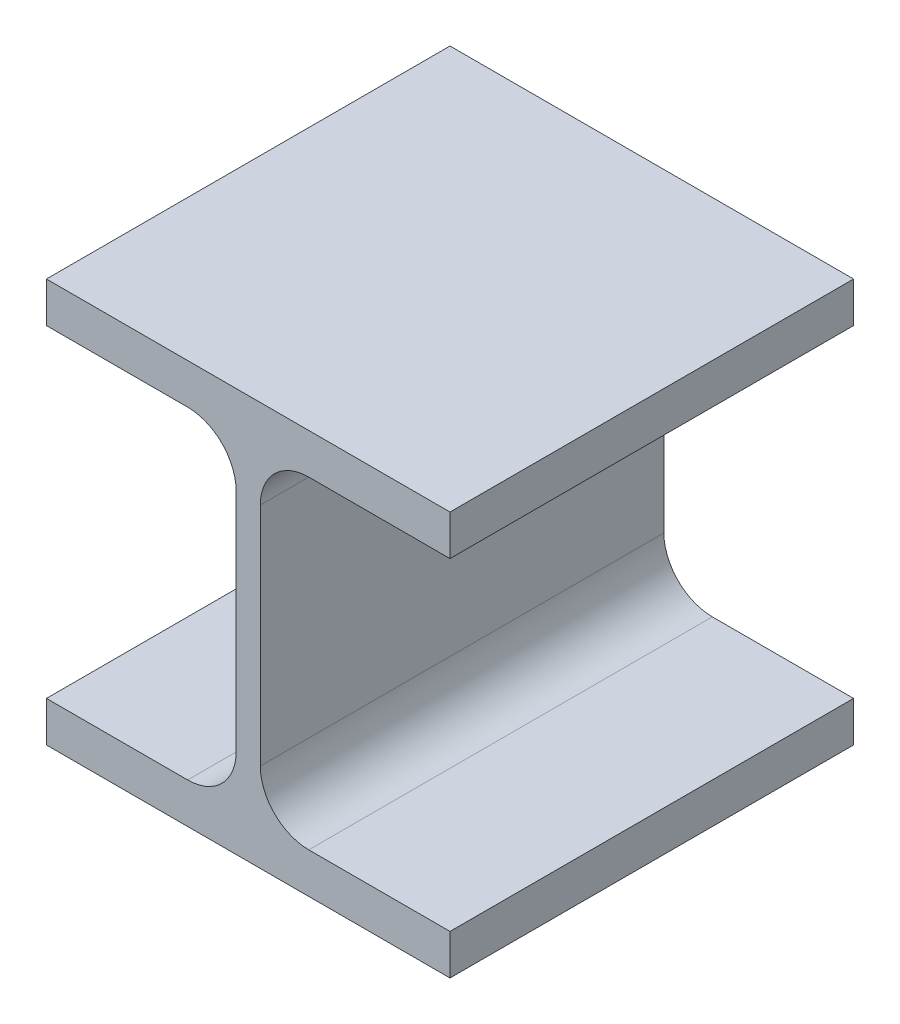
from build123d import *

# Parameters (mm, degrees)
BASIS_LINEAR_AUSTRAGEN_DEPTH = 100


with BuildPart() as part:
    # Skizze1 → Basis-Linear austragen (new body)
    with BuildSketch(Plane.XY):
        with BuildLine():
            Line((-50, 0), (50, 0))
            Line((50, 0), (50, 10))
            Line((50, 10), (15, 10))
            ThreePointArc((15, 10), (6.514718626, 13.514718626), (3, 22))
            Line((3, 22), (3, 78))
            ThreePointArc((3, 78), (6.514718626, 86.485281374), (15, 90))
            Line((15, 90), (50, 90))
            Line((50, 90), (50, 100))
            Line((50, 100), (-50, 100))
            Line((-50, 100), (-50, 90))
            Line((-50, 90), (-15, 90))
            ThreePointArc((-15, 90), (-6.514718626, 86.485281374), (-3, 78))
            Line((-3, 78), (-3, 22))
            ThreePointArc((-3, 22), (-6.514718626, 13.514718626), (-15, 10))
            Line((-15, 10), (-50, 10))
            Line((-50, 10), (-50, 0))
        make_face()
    extrude(amount=-BASIS_LINEAR_AUSTRAGEN_DEPTH)


solid = part.part
